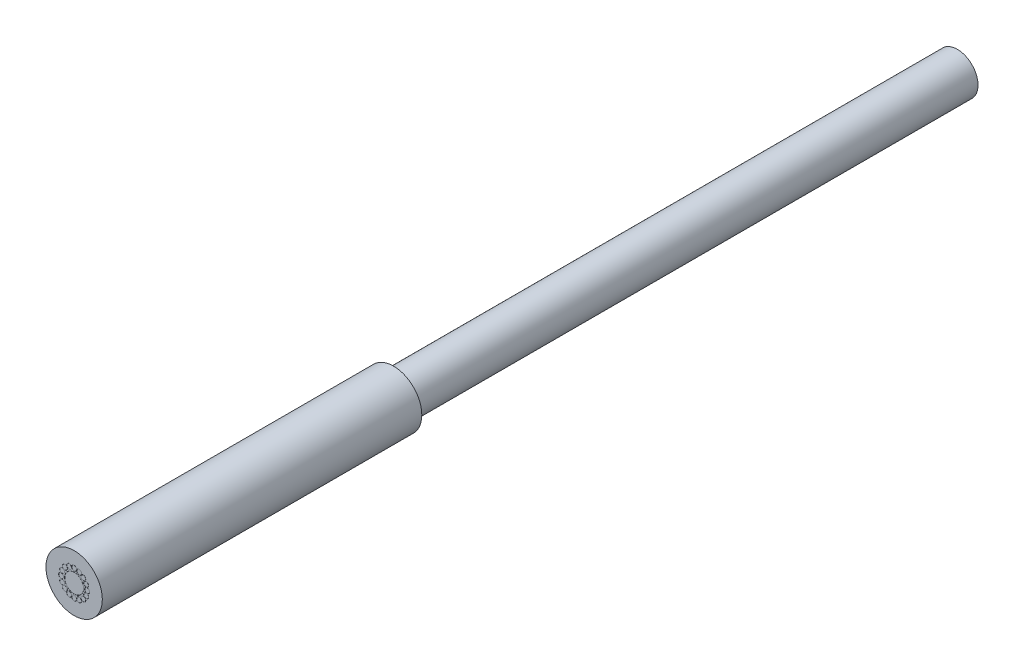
ISO-10303-21;
HEADER;
FILE_DESCRIPTION(('STEP AP214'),'2;1');
FILE_NAME('part.step','',(''),(''),'','','');
FILE_SCHEMA(('AUTOMOTIVE_DESIGN { 1 0 10303 214 1 1 1 1 }'));
ENDSEC;
DATA;
#1=APPLICATION_CONTEXT('core data for automotive mechanical design processes');
#2=APPLICATION_PROTOCOL_DEFINITION('international standard','automotive_design',2000,#1);
#3=PRODUCT_CONTEXT('',#1,'mechanical');
#4=PRODUCT('Part','Part','',(#3));
#5=PRODUCT_RELATED_PRODUCT_CATEGORY('part','',(#4));
#6=PRODUCT_DEFINITION_FORMATION('','',#4);
#7=PRODUCT_DEFINITION_CONTEXT('part definition',#1,'design');
#8=PRODUCT_DEFINITION('design','',#6,#7);
#9=PRODUCT_DEFINITION_SHAPE('','',#8);
#10=(LENGTH_UNIT() NAMED_UNIT(*) SI_UNIT(.MILLI.,.METRE.));
#11=(NAMED_UNIT(*) PLANE_ANGLE_UNIT() SI_UNIT($,.RADIAN.));
#12=(NAMED_UNIT(*) SI_UNIT($,.STERADIAN.) SOLID_ANGLE_UNIT());
#13=UNCERTAINTY_MEASURE_WITH_UNIT(LENGTH_MEASURE(1.E-05),#10,'distance_accuracy_value','');
#14=(GEOMETRIC_REPRESENTATION_CONTEXT(3) GLOBAL_UNCERTAINTY_ASSIGNED_CONTEXT((#13)) GLOBAL_UNIT_ASSIGNED_CONTEXT((#10,
#11,#12)) REPRESENTATION_CONTEXT('',''));
#15=CARTESIAN_POINT('',(0.,0.,0.));
#16=DIRECTION('',(0.,0.,1.));
#17=DIRECTION('',(1.,0.,0.));
#18=AXIS2_PLACEMENT_3D('',#15,#16,#17);
#19=CARTESIAN_POINT('',(0.,0.,-17.));
#20=DIRECTION('',(0.,0.,1.));
#21=DIRECTION('',(1.,0.,0.));
#22=AXIS2_PLACEMENT_3D('',#19,#20,#21);
#23=CYLINDRICAL_SURFACE('',#22,1.5);
#24=CARTESIAN_POINT('',(0.,0.,-17.));
#25=DIRECTION('',(0.,0.,1.));
#26=DIRECTION('',(1.,0.,0.));
#27=AXIS2_PLACEMENT_3D('',#24,#25,#26);
#28=CIRCLE('',#27,1.5);
#29=CARTESIAN_POINT('',(1.5,0.,-17.));
#30=VERTEX_POINT('',#29);
#31=EDGE_CURVE('E40',#30,#30,#28,.T.);
#32=ORIENTED_EDGE('',*,*,#31,.T.);
#33=EDGE_LOOP('',(#32));
#34=FACE_BOUND('',#33,.T.);
#35=CARTESIAN_POINT('',(0.,0.,0.));
#36=DIRECTION('',(0.,0.,1.));
#37=DIRECTION('',(1.,0.,0.));
#38=AXIS2_PLACEMENT_3D('',#35,#36,#37);
#39=CIRCLE('',#38,1.5);
#40=CARTESIAN_POINT('',(1.5,0.,0.));
#41=VERTEX_POINT('',#40);
#42=EDGE_CURVE('E36',#41,#41,#39,.T.);
#43=ORIENTED_EDGE('',*,*,#42,.F.);
#44=EDGE_LOOP('',(#43));
#45=FACE_BOUND('',#44,.T.);
#46=ADVANCED_FACE('F33',(#34,#45),#23,.T.);
#47=CARTESIAN_POINT('',(0.,0.,-17.));
#48=DIRECTION('',(0.,0.,1.));
#49=DIRECTION('',(1.,0.,0.));
#50=AXIS2_PLACEMENT_3D('',#47,#48,#49);
#51=PLANE('',#50);
#52=CARTESIAN_POINT('',(0.,0.,-17.));
#53=DIRECTION('',(0.,0.,-1.));
#54=DIRECTION('',(-1.,0.,0.));
#55=AXIS2_PLACEMENT_3D('',#52,#53,#54);
#56=CIRCLE('',#55,1.1);
#57=CARTESIAN_POINT('',(-1.1,0.,-17.));
#58=VERTEX_POINT('',#57);
#59=EDGE_CURVE('E10',#58,#58,#56,.T.);
#60=ORIENTED_EDGE('',*,*,#59,.F.);
#61=EDGE_LOOP('',(#60));
#62=FACE_BOUND('',#61,.T.);
#63=ORIENTED_EDGE('',*,*,#31,.F.);
#64=EDGE_LOOP('',(#63));
#65=FACE_BOUND('',#64,.T.);
#66=ADVANCED_FACE('F274',(#62,#65),#51,.F.);
#67=CARTESIAN_POINT('',(0.,0.,0.));
#68=DIRECTION('',(0.,0.,1.));
#69=DIRECTION('',(1.,0.,0.));
#70=AXIS2_PLACEMENT_3D('',#67,#68,#69);
#71=PLANE('',#70);
#72=CARTESIAN_POINT('',(0.489308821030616,0.489308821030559,0.));
#73=DIRECTION('',(0.,0.,1.));
#74=DIRECTION('',(1.,0.,0.));
#75=AXIS2_PLACEMENT_3D('',#72,#73,#74);
#76=CIRCLE('',#75,0.13);
#77=CARTESIAN_POINT('',(0.619308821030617,0.489308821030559,0.));
#78=VERTEX_POINT('',#77);
#79=EDGE_CURVE('E136',#78,#78,#76,.T.);
#80=ORIENTED_EDGE('',*,*,#79,.F.);
#81=EDGE_LOOP('',(#80));
#82=FACE_BOUND('',#81,.T.);
#83=CARTESIAN_POINT('',(0.639312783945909,0.264812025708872,0.));
#84=DIRECTION('',(0.,0.,1.));
#85=DIRECTION('',(1.,0.,0.));
#86=AXIS2_PLACEMENT_3D('',#83,#84,#85);
#87=CIRCLE('',#86,0.13);
#88=CARTESIAN_POINT('',(0.769312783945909,0.264812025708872,0.));
#89=VERTEX_POINT('',#88);
#90=EDGE_CURVE('E148',#89,#89,#87,.T.);
#91=ORIENTED_EDGE('',*,*,#90,.F.);
#92=EDGE_LOOP('',(#91));
#93=FACE_BOUND('',#92,.T.);
#94=CARTESIAN_POINT('',(0.26481202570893,0.639312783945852,0.));
#95=DIRECTION('',(0.,0.,1.));
#96=DIRECTION('',(1.,0.,0.));
#97=AXIS2_PLACEMENT_3D('',#94,#95,#96);
#98=CIRCLE('',#97,0.13);
#99=CARTESIAN_POINT('',(0.39481202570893,0.639312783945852,0.));
#100=VERTEX_POINT('',#99);
#101=EDGE_CURVE('E112',#100,#100,#98,.T.);
#102=ORIENTED_EDGE('',*,*,#101,.F.);
#103=EDGE_LOOP('',(#102));
#104=FACE_BOUND('',#103,.T.);
#105=CARTESIAN_POINT('',(0.,0.691987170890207,0.));
#106=DIRECTION('',(0.,0.,1.));
#107=DIRECTION('',(1.,0.,0.));
#108=AXIS2_PLACEMENT_3D('',#105,#106,#107);
#109=CIRCLE('',#108,0.13);
#110=CARTESIAN_POINT('',(0.130000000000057,0.691987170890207,0.));
#111=VERTEX_POINT('',#110);
#112=EDGE_CURVE('E126',#111,#111,#109,.T.);
#113=ORIENTED_EDGE('',*,*,#112,.F.);
#114=EDGE_LOOP('',(#113));
#115=FACE_BOUND('',#114,.T.);
#116=CARTESIAN_POINT('',(0.489308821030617,-0.489308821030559,0.));
#117=DIRECTION('',(0.,0.,1.));
#118=DIRECTION('',(1.,0.,0.));
#119=AXIS2_PLACEMENT_3D('',#116,#117,#118);
#120=CIRCLE('',#119,0.13);
#121=CARTESIAN_POINT('',(0.619308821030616,-0.489308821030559,0.));
#122=VERTEX_POINT('',#121);
#123=EDGE_CURVE('E88',#122,#122,#120,.T.);
#124=ORIENTED_EDGE('',*,*,#123,.F.);
#125=EDGE_LOOP('',(#124));
#126=FACE_BOUND('',#125,.T.);
#127=CARTESIAN_POINT('',(0.264812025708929,-0.639312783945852,0.));
#128=DIRECTION('',(0.,0.,1.));
#129=DIRECTION('',(1.,0.,0.));
#130=AXIS2_PLACEMENT_3D('',#127,#128,#129);
#131=CIRCLE('',#130,0.13);
#132=CARTESIAN_POINT('',(0.39481202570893,-0.639312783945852,0.));
#133=VERTEX_POINT('',#132);
#134=EDGE_CURVE('E100',#133,#133,#131,.T.);
#135=ORIENTED_EDGE('',*,*,#134,.F.);
#136=EDGE_LOOP('',(#135));
#137=FACE_BOUND('',#136,.T.);
#138=CARTESIAN_POINT('',(0.639312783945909,-0.264812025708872,0.));
#139=DIRECTION('',(0.,0.,1.));
#140=DIRECTION('',(1.,0.,0.));
#141=AXIS2_PLACEMENT_3D('',#138,#139,#140);
#142=CIRCLE('',#141,0.13);
#143=CARTESIAN_POINT('',(0.769312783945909,-0.264812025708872,0.));
#144=VERTEX_POINT('',#143);
#145=EDGE_CURVE('E62',#144,#144,#142,.T.);
#146=ORIENTED_EDGE('',*,*,#145,.F.);
#147=EDGE_LOOP('',(#146));
#148=FACE_BOUND('',#147,.T.);
#149=CARTESIAN_POINT('',(0.691987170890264,0.,0.));
#150=DIRECTION('',(0.,0.,1.));
#151=DIRECTION('',(1.,0.,0.));
#152=AXIS2_PLACEMENT_3D('',#149,#150,#151);
#153=CIRCLE('',#152,0.13);
#154=CARTESIAN_POINT('',(0.821987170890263,0.,0.));
#155=VERTEX_POINT('',#154);
#156=EDGE_CURVE('E76',#155,#155,#153,.T.);
#157=ORIENTED_EDGE('',*,*,#156,.F.);
#158=EDGE_LOOP('',(#157));
#159=FACE_BOUND('',#158,.T.);
#160=CARTESIAN_POINT('',(-0.489308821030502,-0.489308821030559,0.));
#161=DIRECTION('',(0.,0.,1.));
#162=DIRECTION('',(1.,0.,0.));
#163=AXIS2_PLACEMENT_3D('',#160,#161,#162);
#164=CIRCLE('',#163,0.13);
#165=CARTESIAN_POINT('',(-0.359308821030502,-0.489308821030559,0.));
#166=VERTEX_POINT('',#165);
#167=EDGE_CURVE('E231',#166,#166,#164,.T.);
#168=ORIENTED_EDGE('',*,*,#167,.F.);
#169=EDGE_LOOP('',(#168));
#170=FACE_BOUND('',#169,.T.);
#171=CARTESIAN_POINT('',(-0.639312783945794,-0.264812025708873,0.));
#172=DIRECTION('',(0.,0.,1.));
#173=DIRECTION('',(1.,0.,0.));
#174=AXIS2_PLACEMENT_3D('',#171,#172,#173);
#175=CIRCLE('',#174,0.13);
#176=CARTESIAN_POINT('',(-0.509312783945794,-0.264812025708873,0.));
#177=VERTEX_POINT('',#176);
#178=EDGE_CURVE('E243',#177,#177,#175,.T.);
#179=ORIENTED_EDGE('',*,*,#178,.F.);
#180=EDGE_LOOP('',(#179));
#181=FACE_BOUND('',#180,.T.);
#182=CARTESIAN_POINT('',(-0.264812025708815,-0.639312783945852,0.));
#183=DIRECTION('',(0.,0.,1.));
#184=DIRECTION('',(1.,0.,0.));
#185=AXIS2_PLACEMENT_3D('',#182,#183,#184);
#186=CIRCLE('',#185,0.13);
#187=CARTESIAN_POINT('',(-0.134812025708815,-0.639312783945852,0.));
#188=VERTEX_POINT('',#187);
#189=EDGE_CURVE('E207',#188,#188,#186,.T.);
#190=ORIENTED_EDGE('',*,*,#189,.F.);
#191=EDGE_LOOP('',(#190));
#192=FACE_BOUND('',#191,.T.);
#193=CARTESIAN_POINT('',(0.,-0.691987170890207,0.));
#194=DIRECTION('',(0.,0.,1.));
#195=DIRECTION('',(1.,0.,0.));
#196=AXIS2_PLACEMENT_3D('',#193,#194,#195);
#197=CIRCLE('',#196,0.13);
#198=CARTESIAN_POINT('',(0.130000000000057,-0.691987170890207,0.));
#199=VERTEX_POINT('',#198);
#200=EDGE_CURVE('E221',#199,#199,#197,.T.);
#201=ORIENTED_EDGE('',*,*,#200,.F.);
#202=EDGE_LOOP('',(#201));
#203=FACE_BOUND('',#202,.T.);
#204=CARTESIAN_POINT('',(-0.489308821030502,0.489308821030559,0.));
#205=DIRECTION('',(0.,0.,1.));
#206=DIRECTION('',(1.,0.,0.));
#207=AXIS2_PLACEMENT_3D('',#204,#205,#206);
#208=CIRCLE('',#207,0.13);
#209=CARTESIAN_POINT('',(-0.359308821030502,0.489308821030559,0.));
#210=VERTEX_POINT('',#209);
#211=EDGE_CURVE('E184',#210,#210,#208,.T.);
#212=ORIENTED_EDGE('',*,*,#211,.F.);
#213=EDGE_LOOP('',(#212));
#214=FACE_BOUND('',#213,.T.);
#215=CARTESIAN_POINT('',(-0.264812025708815,0.639312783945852,0.));
#216=DIRECTION('',(0.,0.,1.));
#217=DIRECTION('',(1.,0.,0.));
#218=AXIS2_PLACEMENT_3D('',#215,#216,#217);
#219=CIRCLE('',#218,0.13);
#220=CARTESIAN_POINT('',(-0.134812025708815,0.639312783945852,0.));
#221=VERTEX_POINT('',#220);
#222=EDGE_CURVE('E196',#221,#221,#219,.T.);
#223=ORIENTED_EDGE('',*,*,#222,.F.);
#224=EDGE_LOOP('',(#223));
#225=FACE_BOUND('',#224,.T.);
#226=CARTESIAN_POINT('',(-0.639312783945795,0.264812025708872,0.));
#227=DIRECTION('',(0.,0.,1.));
#228=DIRECTION('',(1.,0.,0.));
#229=AXIS2_PLACEMENT_3D('',#226,#227,#228);
#230=CIRCLE('',#229,0.13);
#231=CARTESIAN_POINT('',(-0.509312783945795,0.264812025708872,0.));
#232=VERTEX_POINT('',#231);
#233=EDGE_CURVE('E158',#232,#232,#230,.T.);
#234=ORIENTED_EDGE('',*,*,#233,.F.);
#235=EDGE_LOOP('',(#234));
#236=FACE_BOUND('',#235,.T.);
#237=CARTESIAN_POINT('',(-0.691987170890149,0.,0.));
#238=DIRECTION('',(0.,0.,1.));
#239=DIRECTION('',(1.,0.,0.));
#240=AXIS2_PLACEMENT_3D('',#237,#238,#239);
#241=CIRCLE('',#240,0.13);
#242=CARTESIAN_POINT('',(-0.561987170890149,0.,0.));
#243=VERTEX_POINT('',#242);
#244=EDGE_CURVE('E172',#243,#243,#241,.T.);
#245=ORIENTED_EDGE('',*,*,#244,.F.);
#246=EDGE_LOOP('',(#245));
#247=FACE_BOUND('',#246,.T.);
#248=CARTESIAN_POINT('',(0.,0.,0.));
#249=DIRECTION('',(0.,0.,1.));
#250=DIRECTION('',(1.,0.,0.));
#251=AXIS2_PLACEMENT_3D('',#248,#249,#250);
#252=CIRCLE('',#251,0.505);
#253=CARTESIAN_POINT('',(0.505,0.,0.));
#254=VERTEX_POINT('',#253);
#255=EDGE_CURVE('E50',#254,#254,#252,.T.);
#256=ORIENTED_EDGE('',*,*,#255,.F.);
#257=EDGE_LOOP('',(#256));
#258=FACE_BOUND('',#257,.T.);
#259=ORIENTED_EDGE('',*,*,#42,.T.);
#260=EDGE_LOOP('',(#259));
#261=FACE_BOUND('',#260,.T.);
#262=ADVANCED_FACE('F270',(#82,#93,#104,#115,#126,#137,#148,#159,#170,#181,#192,#203,#214,#225,
#236,#247,#258,#261),#71,.T.);
#263=CARTESIAN_POINT('',(0.,0.,-47.));
#264=DIRECTION('',(0.,0.,1.));
#265=DIRECTION('',(1.,0.,0.));
#266=AXIS2_PLACEMENT_3D('',#263,#264,#265);
#267=CYLINDRICAL_SURFACE('',#266,1.1);
#268=CARTESIAN_POINT('',(0.,0.,-47.));
#269=DIRECTION('',(0.,0.,-1.));
#270=DIRECTION('',(-1.,0.,0.));
#271=AXIS2_PLACEMENT_3D('',#268,#269,#270);
#272=CIRCLE('',#271,1.1);
#273=CARTESIAN_POINT('',(-1.1,0.,-47.));
#274=VERTEX_POINT('',#273);
#275=EDGE_CURVE('E46',#274,#274,#272,.T.);
#276=ORIENTED_EDGE('',*,*,#275,.F.);
#277=EDGE_LOOP('',(#276));
#278=FACE_BOUND('',#277,.T.);
#279=ORIENTED_EDGE('',*,*,#59,.T.);
#280=EDGE_LOOP('',(#279));
#281=FACE_BOUND('',#280,.T.);
#282=ADVANCED_FACE('F273',(#278,#281),#267,.T.);
#283=CARTESIAN_POINT('',(0.,0.,-47.));
#284=DIRECTION('',(0.,0.,-1.));
#285=DIRECTION('',(-1.,0.,0.));
#286=AXIS2_PLACEMENT_3D('',#283,#284,#285);
#287=PLANE('',#286);
#288=ORIENTED_EDGE('',*,*,#275,.T.);
#289=EDGE_LOOP('',(#288));
#290=FACE_BOUND('',#289,.T.);
#291=ADVANCED_FACE('F309',(#290),#287,.T.);
#292=CARTESIAN_POINT('',(0.,0.,-0.1));
#293=DIRECTION('',(0.,0.,1.));
#294=DIRECTION('',(1.,0.,0.));
#295=AXIS2_PLACEMENT_3D('',#292,#293,#294);
#296=CYLINDRICAL_SURFACE('',#295,0.505);
#297=CARTESIAN_POINT('',(0.,0.,-0.1));
#298=DIRECTION('',(0.,0.,1.));
#299=DIRECTION('',(1.,0.,0.));
#300=AXIS2_PLACEMENT_3D('',#297,#298,#299);
#301=CIRCLE('',#300,0.505);
#302=CARTESIAN_POINT('',(0.505,0.,-0.1));
#303=VERTEX_POINT('',#302);
#304=EDGE_CURVE('E49',#303,#303,#301,.T.);
#305=ORIENTED_EDGE('',*,*,#304,.F.);
#306=EDGE_LOOP('',(#305));
#307=FACE_BOUND('',#306,.T.);
#308=ORIENTED_EDGE('',*,*,#255,.T.);
#309=EDGE_LOOP('',(#308));
#310=FACE_BOUND('',#309,.T.);
#311=ADVANCED_FACE('F313',(#307,#310),#296,.F.);
#312=CARTESIAN_POINT('',(0.,0.,-0.1));
#313=DIRECTION('',(0.,0.,1.));
#314=DIRECTION('',(1.,0.,0.));
#315=AXIS2_PLACEMENT_3D('',#312,#313,#314);
#316=PLANE('',#315);
#317=CARTESIAN_POINT('',(0.,0.,-0.1));
#318=DIRECTION('',(0.,0.,1.));
#319=DIRECTION('',(1.,0.,0.));
#320=AXIS2_PLACEMENT_3D('',#317,#318,#319);
#321=CIRCLE('',#320,0.5);
#322=CARTESIAN_POINT('',(0.5,0.,-0.1));
#323=VERTEX_POINT('',#322);
#324=EDGE_CURVE('E53',#323,#323,#321,.T.);
#325=ORIENTED_EDGE('',*,*,#324,.F.);
#326=EDGE_LOOP('',(#325));
#327=FACE_BOUND('',#326,.T.);
#328=ORIENTED_EDGE('',*,*,#304,.T.);
#329=EDGE_LOOP('',(#328));
#330=FACE_BOUND('',#329,.T.);
#331=ADVANCED_FACE('F317',(#327,#330),#316,.T.);
#332=CARTESIAN_POINT('',(0.,0.,-0.1));
#333=DIRECTION('',(0.,0.,1.));
#334=DIRECTION('',(1.,0.,0.));
#335=AXIS2_PLACEMENT_3D('',#332,#333,#334);
#336=CYLINDRICAL_SURFACE('',#335,0.5);
#337=ORIENTED_EDGE('',*,*,#324,.T.);
#338=EDGE_LOOP('',(#337));
#339=FACE_BOUND('',#338,.T.);
#340=CARTESIAN_POINT('',(0.,0.,0.));
#341=DIRECTION('',(0.,0.,1.));
#342=DIRECTION('',(1.,0.,0.));
#343=AXIS2_PLACEMENT_3D('',#340,#341,#342);
#344=CIRCLE('',#343,0.5);
#345=CARTESIAN_POINT('',(0.5,0.,0.));
#346=VERTEX_POINT('',#345);
#347=EDGE_CURVE('E56',#346,#346,#344,.T.);
#348=ORIENTED_EDGE('',*,*,#347,.F.);
#349=EDGE_LOOP('',(#348));
#350=FACE_BOUND('',#349,.T.);
#351=ADVANCED_FACE('F321',(#339,#350),#336,.T.);
#352=CARTESIAN_POINT('',(-0.691987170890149,0.,-0.1));
#353=DIRECTION('',(0.,0.,1.));
#354=DIRECTION('',(1.,0.,0.));
#355=AXIS2_PLACEMENT_3D('',#352,#353,#354);
#356=CYLINDRICAL_SURFACE('',#355,0.13);
#357=CARTESIAN_POINT('',(-0.691987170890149,0.,-0.1));
#358=DIRECTION('',(0.,0.,1.));
#359=DIRECTION('',(1.,0.,0.));
#360=AXIS2_PLACEMENT_3D('',#357,#358,#359);
#361=CIRCLE('',#360,0.13);
#362=CARTESIAN_POINT('',(-0.561987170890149,0.,-0.1));
#363=VERTEX_POINT('',#362);
#364=EDGE_CURVE('E175',#363,#363,#361,.T.);
#365=ORIENTED_EDGE('',*,*,#364,.F.);
#366=EDGE_LOOP('',(#365));
#367=FACE_BOUND('',#366,.T.);
#368=ORIENTED_EDGE('',*,*,#244,.T.);
#369=EDGE_LOOP('',(#368));
#370=FACE_BOUND('',#369,.T.);
#371=ADVANCED_FACE('F325',(#367,#370),#356,.F.);
#372=CARTESIAN_POINT('',(-0.691987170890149,0.,-0.1));
#373=DIRECTION('',(0.,0.,1.));
#374=DIRECTION('',(1.,0.,0.));
#375=AXIS2_PLACEMENT_3D('',#372,#373,#374);
#376=PLANE('',#375);
#377=CARTESIAN_POINT('',(-0.691987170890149,0.,-0.1));
#378=DIRECTION('',(0.,0.,1.));
#379=DIRECTION('',(1.,0.,0.));
#380=AXIS2_PLACEMENT_3D('',#377,#378,#379);
#381=CIRCLE('',#380,0.125);
#382=CARTESIAN_POINT('',(-0.566987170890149,0.,-0.1));
#383=VERTEX_POINT('',#382);
#384=EDGE_CURVE('E176',#383,#383,#381,.T.);
#385=ORIENTED_EDGE('',*,*,#384,.F.);
#386=EDGE_LOOP('',(#385));
#387=FACE_BOUND('',#386,.T.);
#388=ORIENTED_EDGE('',*,*,#364,.T.);
#389=EDGE_LOOP('',(#388));
#390=FACE_BOUND('',#389,.T.);
#391=ADVANCED_FACE('F440',(#387,#390),#376,.T.);
#392=CARTESIAN_POINT('',(-0.691987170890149,0.,-0.1));
#393=DIRECTION('',(0.,0.,1.));
#394=DIRECTION('',(1.,0.,0.));
#395=AXIS2_PLACEMENT_3D('',#392,#393,#394);
#396=CYLINDRICAL_SURFACE('',#395,0.125);
#397=ORIENTED_EDGE('',*,*,#384,.T.);
#398=EDGE_LOOP('',(#397));
#399=FACE_BOUND('',#398,.T.);
#400=CARTESIAN_POINT('',(-0.691987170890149,0.,0.));
#401=DIRECTION('',(0.,0.,1.));
#402=DIRECTION('',(1.,0.,0.));
#403=AXIS2_PLACEMENT_3D('',#400,#401,#402);
#404=CIRCLE('',#403,0.125);
#405=CARTESIAN_POINT('',(-0.566987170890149,0.,0.));
#406=VERTEX_POINT('',#405);
#407=EDGE_CURVE('E165',#406,#406,#404,.T.);
#408=ORIENTED_EDGE('',*,*,#407,.F.);
#409=EDGE_LOOP('',(#408));
#410=FACE_BOUND('',#409,.T.);
#411=ADVANCED_FACE('F428',(#399,#410),#396,.T.);
#412=CARTESIAN_POINT('',(-0.639312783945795,0.264812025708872,-0.1));
#413=DIRECTION('',(0.,0.,1.));
#414=DIRECTION('',(1.,0.,0.));
#415=AXIS2_PLACEMENT_3D('',#412,#413,#414);
#416=CYLINDRICAL_SURFACE('',#415,0.13);
#417=CARTESIAN_POINT('',(-0.639312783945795,0.264812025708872,-0.1));
#418=DIRECTION('',(0.,0.,1.));
#419=DIRECTION('',(1.,0.,0.));
#420=AXIS2_PLACEMENT_3D('',#417,#418,#419);
#421=CIRCLE('',#420,0.13);
#422=CARTESIAN_POINT('',(-0.509312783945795,0.264812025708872,-0.1));
#423=VERTEX_POINT('',#422);
#424=EDGE_CURVE('E161',#423,#423,#421,.T.);
#425=ORIENTED_EDGE('',*,*,#424,.F.);
#426=EDGE_LOOP('',(#425));
#427=FACE_BOUND('',#426,.T.);
#428=ORIENTED_EDGE('',*,*,#233,.T.);
#429=EDGE_LOOP('',(#428));
#430=FACE_BOUND('',#429,.T.);
#431=ADVANCED_FACE('F424',(#427,#430),#416,.F.);
#432=CARTESIAN_POINT('',(-0.639312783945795,0.264812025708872,-0.1));
#433=DIRECTION('',(0.,0.,1.));
#434=DIRECTION('',(1.,0.,0.));
#435=AXIS2_PLACEMENT_3D('',#432,#433,#434);
#436=PLANE('',#435);
#437=CARTESIAN_POINT('',(-0.639312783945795,0.264812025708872,-0.1));
#438=DIRECTION('',(0.,0.,1.));
#439=DIRECTION('',(1.,0.,0.));
#440=AXIS2_PLACEMENT_3D('',#437,#438,#439);
#441=CIRCLE('',#440,0.125);
#442=CARTESIAN_POINT('',(-0.514312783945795,0.264812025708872,-0.1));
#443=VERTEX_POINT('',#442);
#444=EDGE_CURVE('E162',#443,#443,#441,.T.);
#445=ORIENTED_EDGE('',*,*,#444,.F.);
#446=EDGE_LOOP('',(#445));
#447=FACE_BOUND('',#446,.T.);
#448=ORIENTED_EDGE('',*,*,#424,.T.);
#449=EDGE_LOOP('',(#448));
#450=FACE_BOUND('',#449,.T.);
#451=ADVANCED_FACE('F427',(#447,#450),#436,.T.);
#452=CARTESIAN_POINT('',(-0.639312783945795,0.264812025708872,-0.1));
#453=DIRECTION('',(0.,0.,1.));
#454=DIRECTION('',(1.,0.,0.));
#455=AXIS2_PLACEMENT_3D('',#452,#453,#454);
#456=CYLINDRICAL_SURFACE('',#455,0.125);
#457=ORIENTED_EDGE('',*,*,#444,.T.);
#458=EDGE_LOOP('',(#457));
#459=FACE_BOUND('',#458,.T.);
#460=CARTESIAN_POINT('',(-0.639312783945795,0.264812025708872,0.));
#461=DIRECTION('',(0.,0.,1.));
#462=DIRECTION('',(1.,0.,0.));
#463=AXIS2_PLACEMENT_3D('',#460,#461,#462);
#464=CIRCLE('',#463,0.125);
#465=CARTESIAN_POINT('',(-0.514312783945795,0.264812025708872,0.));
#466=VERTEX_POINT('',#465);
#467=EDGE_CURVE('E166',#466,#466,#464,.T.);
#468=ORIENTED_EDGE('',*,*,#467,.F.);
#469=EDGE_LOOP('',(#468));
#470=FACE_BOUND('',#469,.T.);
#471=ADVANCED_FACE('F432',(#459,#470),#456,.T.);
#472=CARTESIAN_POINT('',(-0.264812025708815,0.639312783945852,-0.1));
#473=DIRECTION('',(0.,0.,1.));
#474=DIRECTION('',(1.,0.,0.));
#475=AXIS2_PLACEMENT_3D('',#472,#473,#474);
#476=CYLINDRICAL_SURFACE('',#475,0.13);
#477=CARTESIAN_POINT('',(-0.264812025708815,0.639312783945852,-0.1));
#478=DIRECTION('',(0.,0.,1.));
#479=DIRECTION('',(1.,0.,0.));
#480=AXIS2_PLACEMENT_3D('',#477,#478,#479);
#481=CIRCLE('',#480,0.13);
#482=CARTESIAN_POINT('',(-0.134812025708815,0.639312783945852,-0.1));
#483=VERTEX_POINT('',#482);
#484=EDGE_CURVE('E193',#483,#483,#481,.T.);
#485=ORIENTED_EDGE('',*,*,#484,.F.);
#486=EDGE_LOOP('',(#485));
#487=FACE_BOUND('',#486,.T.);
#488=ORIENTED_EDGE('',*,*,#222,.T.);
#489=EDGE_LOOP('',(#488));
#490=FACE_BOUND('',#489,.T.);
#491=ADVANCED_FACE('F436',(#487,#490),#476,.F.);
#492=CARTESIAN_POINT('',(-0.264812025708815,0.639312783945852,-0.1));
#493=DIRECTION('',(0.,0.,1.));
#494=DIRECTION('',(1.,0.,0.));
#495=AXIS2_PLACEMENT_3D('',#492,#493,#494);
#496=PLANE('',#495);
#497=CARTESIAN_POINT('',(-0.264812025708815,0.639312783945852,-0.1));
#498=DIRECTION('',(0.,0.,1.));
#499=DIRECTION('',(1.,0.,0.));
#500=AXIS2_PLACEMENT_3D('',#497,#498,#499);
#501=CIRCLE('',#500,0.125);
#502=CARTESIAN_POINT('',(-0.139812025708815,0.639312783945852,-0.1));
#503=VERTEX_POINT('',#502);
#504=EDGE_CURVE('E199',#503,#503,#501,.T.);
#505=ORIENTED_EDGE('',*,*,#504,.F.);
#506=EDGE_LOOP('',(#505));
#507=FACE_BOUND('',#506,.T.);
#508=ORIENTED_EDGE('',*,*,#484,.T.);
#509=EDGE_LOOP('',(#508));
#510=FACE_BOUND('',#509,.T.);
#511=ADVANCED_FACE('F464',(#507,#510),#496,.T.);
#512=CARTESIAN_POINT('',(-0.264812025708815,0.639312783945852,-0.1));
#513=DIRECTION('',(0.,0.,1.));
#514=DIRECTION('',(1.,0.,0.));
#515=AXIS2_PLACEMENT_3D('',#512,#513,#514);
#516=CYLINDRICAL_SURFACE('',#515,0.125);
#517=ORIENTED_EDGE('',*,*,#504,.T.);
#518=EDGE_LOOP('',(#517));
#519=FACE_BOUND('',#518,.T.);
#520=CARTESIAN_POINT('',(-0.264812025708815,0.639312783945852,0.));
#521=DIRECTION('',(0.,0.,1.));
#522=DIRECTION('',(1.,0.,0.));
#523=AXIS2_PLACEMENT_3D('',#520,#521,#522);
#524=CIRCLE('',#523,0.125);
#525=CARTESIAN_POINT('',(-0.139812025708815,0.639312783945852,0.));
#526=VERTEX_POINT('',#525);
#527=EDGE_CURVE('E202',#526,#526,#524,.T.);
#528=ORIENTED_EDGE('',*,*,#527,.F.);
#529=EDGE_LOOP('',(#528));
#530=FACE_BOUND('',#529,.T.);
#531=ADVANCED_FACE('F452',(#519,#530),#516,.T.);
#532=CARTESIAN_POINT('',(-0.489308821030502,0.489308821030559,-0.1));
#533=DIRECTION('',(0.,0.,1.));
#534=DIRECTION('',(1.,0.,0.));
#535=AXIS2_PLACEMENT_3D('',#532,#533,#534);
#536=CYLINDRICAL_SURFACE('',#535,0.13);
#537=CARTESIAN_POINT('',(-0.489308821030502,0.489308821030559,-0.1));
#538=DIRECTION('',(0.,0.,1.));
#539=DIRECTION('',(1.,0.,0.));
#540=AXIS2_PLACEMENT_3D('',#537,#538,#539);
#541=CIRCLE('',#540,0.13);
#542=CARTESIAN_POINT('',(-0.359308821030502,0.489308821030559,-0.1));
#543=VERTEX_POINT('',#542);
#544=EDGE_CURVE('E169',#543,#543,#541,.T.);
#545=ORIENTED_EDGE('',*,*,#544,.F.);
#546=EDGE_LOOP('',(#545));
#547=FACE_BOUND('',#546,.T.);
#548=ORIENTED_EDGE('',*,*,#211,.T.);
#549=EDGE_LOOP('',(#548));
#550=FACE_BOUND('',#549,.T.);
#551=ADVANCED_FACE('F448',(#547,#550),#536,.F.);
#552=CARTESIAN_POINT('',(-0.489308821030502,0.489308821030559,-0.1));
#553=DIRECTION('',(0.,0.,1.));
#554=DIRECTION('',(1.,0.,0.));
#555=AXIS2_PLACEMENT_3D('',#552,#553,#554);
#556=PLANE('',#555);
#557=CARTESIAN_POINT('',(-0.489308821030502,0.489308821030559,-0.1));
#558=DIRECTION('',(0.,0.,1.));
#559=DIRECTION('',(1.,0.,0.));
#560=AXIS2_PLACEMENT_3D('',#557,#558,#559);
#561=CIRCLE('',#560,0.125);
#562=CARTESIAN_POINT('',(-0.364308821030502,0.489308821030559,-0.1));
#563=VERTEX_POINT('',#562);
#564=EDGE_CURVE('E187',#563,#563,#561,.T.);
#565=ORIENTED_EDGE('',*,*,#564,.F.);
#566=EDGE_LOOP('',(#565));
#567=FACE_BOUND('',#566,.T.);
#568=ORIENTED_EDGE('',*,*,#544,.T.);
#569=EDGE_LOOP('',(#568));
#570=FACE_BOUND('',#569,.T.);
#571=ADVANCED_FACE('F451',(#567,#570),#556,.T.);
#572=CARTESIAN_POINT('',(-0.489308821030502,0.489308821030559,-0.1));
#573=DIRECTION('',(0.,0.,1.));
#574=DIRECTION('',(1.,0.,0.));
#575=AXIS2_PLACEMENT_3D('',#572,#573,#574);
#576=CYLINDRICAL_SURFACE('',#575,0.125);
#577=ORIENTED_EDGE('',*,*,#564,.T.);
#578=EDGE_LOOP('',(#577));
#579=FACE_BOUND('',#578,.T.);
#580=CARTESIAN_POINT('',(-0.489308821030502,0.489308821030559,0.));
#581=DIRECTION('',(0.,0.,1.));
#582=DIRECTION('',(1.,0.,0.));
#583=AXIS2_PLACEMENT_3D('',#580,#581,#582);
#584=CIRCLE('',#583,0.125);
#585=CARTESIAN_POINT('',(-0.364308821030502,0.489308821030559,0.));
#586=VERTEX_POINT('',#585);
#587=EDGE_CURVE('E190',#586,#586,#584,.T.);
#588=ORIENTED_EDGE('',*,*,#587,.F.);
#589=EDGE_LOOP('',(#588));
#590=FACE_BOUND('',#589,.T.);
#591=ADVANCED_FACE('F456',(#579,#590),#576,.T.);
#592=CARTESIAN_POINT('',(0.,-0.691987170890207,-0.1));
#593=DIRECTION('',(0.,0.,1.));
#594=DIRECTION('',(1.,0.,0.));
#595=AXIS2_PLACEMENT_3D('',#592,#593,#594);
#596=CYLINDRICAL_SURFACE('',#595,0.13);
#597=CARTESIAN_POINT('',(0.,-0.691987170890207,-0.1));
#598=DIRECTION('',(0.,0.,1.));
#599=DIRECTION('',(1.,0.,0.));
#600=AXIS2_PLACEMENT_3D('',#597,#598,#599);
#601=CIRCLE('',#600,0.13);
#602=CARTESIAN_POINT('',(0.130000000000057,-0.691987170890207,-0.1));
#603=VERTEX_POINT('',#602);
#604=EDGE_CURVE('E109',#603,#603,#601,.T.);
#605=ORIENTED_EDGE('',*,*,#604,.F.);
#606=EDGE_LOOP('',(#605));
#607=FACE_BOUND('',#606,.T.);
#608=ORIENTED_EDGE('',*,*,#200,.T.);
#609=EDGE_LOOP('',(#608));
#610=FACE_BOUND('',#609,.T.);
#611=ADVANCED_FACE('F460',(#607,#610),#596,.F.);
#612=CARTESIAN_POINT('',(0.,-0.691987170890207,-0.1));
#613=DIRECTION('',(0.,0.,1.));
#614=DIRECTION('',(1.,0.,0.));
#615=AXIS2_PLACEMENT_3D('',#612,#613,#614);
#616=PLANE('',#615);
#617=CARTESIAN_POINT('',(0.,-0.691987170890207,-0.1));
#618=DIRECTION('',(0.,0.,1.));
#619=DIRECTION('',(1.,0.,0.));
#620=AXIS2_PLACEMENT_3D('',#617,#618,#619);
#621=CIRCLE('',#620,0.125);
#622=CARTESIAN_POINT('',(0.125000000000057,-0.691987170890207,-0.1));
#623=VERTEX_POINT('',#622);
#624=EDGE_CURVE('E224',#623,#623,#621,.T.);
#625=ORIENTED_EDGE('',*,*,#624,.F.);
#626=EDGE_LOOP('',(#625));
#627=FACE_BOUND('',#626,.T.);
#628=ORIENTED_EDGE('',*,*,#604,.T.);
#629=EDGE_LOOP('',(#628));
#630=FACE_BOUND('',#629,.T.);
#631=ADVANCED_FACE('F486',(#627,#630),#616,.T.);
#632=CARTESIAN_POINT('',(0.,-0.691987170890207,-0.1));
#633=DIRECTION('',(0.,0.,1.));
#634=DIRECTION('',(1.,0.,0.));
#635=AXIS2_PLACEMENT_3D('',#632,#633,#634);
#636=CYLINDRICAL_SURFACE('',#635,0.125);
#637=ORIENTED_EDGE('',*,*,#624,.T.);
#638=EDGE_LOOP('',(#637));
#639=FACE_BOUND('',#638,.T.);
#640=CARTESIAN_POINT('',(0.,-0.691987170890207,0.));
#641=DIRECTION('',(0.,0.,1.));
#642=DIRECTION('',(1.,0.,0.));
#643=AXIS2_PLACEMENT_3D('',#640,#641,#642);
#644=CIRCLE('',#643,0.125);
#645=CARTESIAN_POINT('',(0.125000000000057,-0.691987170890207,0.));
#646=VERTEX_POINT('',#645);
#647=EDGE_CURVE('E214',#646,#646,#644,.T.);
#648=ORIENTED_EDGE('',*,*,#647,.F.);
#649=EDGE_LOOP('',(#648));
#650=FACE_BOUND('',#649,.T.);
#651=ADVANCED_FACE('F476',(#639,#650),#636,.T.);
#652=CARTESIAN_POINT('',(-0.264812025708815,-0.639312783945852,-0.1));
#653=DIRECTION('',(0.,0.,1.));
#654=DIRECTION('',(1.,0.,0.));
#655=AXIS2_PLACEMENT_3D('',#652,#653,#654);
#656=CYLINDRICAL_SURFACE('',#655,0.13);
#657=CARTESIAN_POINT('',(-0.264812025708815,-0.639312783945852,-0.1));
#658=DIRECTION('',(0.,0.,1.));
#659=DIRECTION('',(1.,0.,0.));
#660=AXIS2_PLACEMENT_3D('',#657,#658,#659);
#661=CIRCLE('',#660,0.13);
#662=CARTESIAN_POINT('',(-0.134812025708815,-0.639312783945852,-0.1));
#663=VERTEX_POINT('',#662);
#664=EDGE_CURVE('E210',#663,#663,#661,.T.);
#665=ORIENTED_EDGE('',*,*,#664,.F.);
#666=EDGE_LOOP('',(#665));
#667=FACE_BOUND('',#666,.T.);
#668=ORIENTED_EDGE('',*,*,#189,.T.);
#669=EDGE_LOOP('',(#668));
#670=FACE_BOUND('',#669,.T.);
#671=ADVANCED_FACE('F472',(#667,#670),#656,.F.);
#672=CARTESIAN_POINT('',(-0.264812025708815,-0.639312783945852,-0.1));
#673=DIRECTION('',(0.,0.,1.));
#674=DIRECTION('',(1.,0.,0.));
#675=AXIS2_PLACEMENT_3D('',#672,#673,#674);
#676=PLANE('',#675);
#677=CARTESIAN_POINT('',(-0.264812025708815,-0.639312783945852,-0.1));
#678=DIRECTION('',(0.,0.,1.));
#679=DIRECTION('',(1.,0.,0.));
#680=AXIS2_PLACEMENT_3D('',#677,#678,#679);
#681=CIRCLE('',#680,0.125);
#682=CARTESIAN_POINT('',(-0.139812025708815,-0.639312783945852,-0.1));
#683=VERTEX_POINT('',#682);
#684=EDGE_CURVE('E211',#683,#683,#681,.T.);
#685=ORIENTED_EDGE('',*,*,#684,.F.);
#686=EDGE_LOOP('',(#685));
#687=FACE_BOUND('',#686,.T.);
#688=ORIENTED_EDGE('',*,*,#664,.T.);
#689=EDGE_LOOP('',(#688));
#690=FACE_BOUND('',#689,.T.);
#691=ADVANCED_FACE('F475',(#687,#690),#676,.T.);
#692=CARTESIAN_POINT('',(-0.264812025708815,-0.639312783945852,-0.1));
#693=DIRECTION('',(0.,0.,1.));
#694=DIRECTION('',(1.,0.,0.));
#695=AXIS2_PLACEMENT_3D('',#692,#693,#694);
#696=CYLINDRICAL_SURFACE('',#695,0.125);
#697=ORIENTED_EDGE('',*,*,#684,.T.);
#698=EDGE_LOOP('',(#697));
#699=FACE_BOUND('',#698,.T.);
#700=CARTESIAN_POINT('',(-0.264812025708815,-0.639312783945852,0.));
#701=DIRECTION('',(0.,0.,1.));
#702=DIRECTION('',(1.,0.,0.));
#703=AXIS2_PLACEMENT_3D('',#700,#701,#702);
#704=CIRCLE('',#703,0.125);
#705=CARTESIAN_POINT('',(-0.139812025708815,-0.639312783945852,0.));
#706=VERTEX_POINT('',#705);
#707=EDGE_CURVE('E215',#706,#706,#704,.T.);
#708=ORIENTED_EDGE('',*,*,#707,.F.);
#709=EDGE_LOOP('',(#708));
#710=FACE_BOUND('',#709,.T.);
#711=ADVANCED_FACE('F266',(#699,#710),#696,.T.);
#712=CARTESIAN_POINT('',(-0.639312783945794,-0.264812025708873,-0.1));
#713=DIRECTION('',(0.,0.,1.));
#714=DIRECTION('',(1.,0.,0.));
#715=AXIS2_PLACEMENT_3D('',#712,#713,#714);
#716=CYLINDRICAL_SURFACE('',#715,0.13);
#717=CARTESIAN_POINT('',(-0.639312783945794,-0.264812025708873,-0.1));
#718=DIRECTION('',(0.,0.,1.));
#719=DIRECTION('',(1.,0.,0.));
#720=AXIS2_PLACEMENT_3D('',#717,#718,#719);
#721=CIRCLE('',#720,0.13);
#722=CARTESIAN_POINT('',(-0.509312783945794,-0.264812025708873,-0.1));
#723=VERTEX_POINT('',#722);
#724=EDGE_CURVE('E240',#723,#723,#721,.T.);
#725=ORIENTED_EDGE('',*,*,#724,.F.);
#726=EDGE_LOOP('',(#725));
#727=FACE_BOUND('',#726,.T.);
#728=ORIENTED_EDGE('',*,*,#178,.T.);
#729=EDGE_LOOP('',(#728));
#730=FACE_BOUND('',#729,.T.);
#731=ADVANCED_FACE('F260',(#727,#730),#716,.F.);
#732=CARTESIAN_POINT('',(-0.639312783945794,-0.264812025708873,-0.1));
#733=DIRECTION('',(0.,0.,1.));
#734=DIRECTION('',(1.,0.,0.));
#735=AXIS2_PLACEMENT_3D('',#732,#733,#734);
#736=PLANE('',#735);
#737=CARTESIAN_POINT('',(-0.639312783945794,-0.264812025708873,-0.1));
#738=DIRECTION('',(0.,0.,1.));
#739=DIRECTION('',(1.,0.,0.));
#740=AXIS2_PLACEMENT_3D('',#737,#738,#739);
#741=CIRCLE('',#740,0.125);
#742=CARTESIAN_POINT('',(-0.514312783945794,-0.264812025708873,-0.1));
#743=VERTEX_POINT('',#742);
#744=EDGE_CURVE('E246',#743,#743,#741,.T.);
#745=ORIENTED_EDGE('',*,*,#744,.F.);
#746=EDGE_LOOP('',(#745));
#747=FACE_BOUND('',#746,.T.);
#748=ORIENTED_EDGE('',*,*,#724,.T.);
#749=EDGE_LOOP('',(#748));
#750=FACE_BOUND('',#749,.T.);
#751=ADVANCED_FACE('F257',(#747,#750),#736,.T.);
#752=CARTESIAN_POINT('',(-0.639312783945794,-0.264812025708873,-0.1));
#753=DIRECTION('',(0.,0.,1.));
#754=DIRECTION('',(1.,0.,0.));
#755=AXIS2_PLACEMENT_3D('',#752,#753,#754);
#756=CYLINDRICAL_SURFACE('',#755,0.125);
#757=ORIENTED_EDGE('',*,*,#744,.T.);
#758=EDGE_LOOP('',(#757));
#759=FACE_BOUND('',#758,.T.);
#760=CARTESIAN_POINT('',(-0.639312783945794,-0.264812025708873,0.));
#761=DIRECTION('',(0.,0.,1.));
#762=DIRECTION('',(1.,0.,0.));
#763=AXIS2_PLACEMENT_3D('',#760,#761,#762);
#764=CIRCLE('',#763,0.125);
#765=CARTESIAN_POINT('',(-0.514312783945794,-0.264812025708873,0.));
#766=VERTEX_POINT('',#765);
#767=EDGE_CURVE('E179',#766,#766,#764,.T.);
#768=ORIENTED_EDGE('',*,*,#767,.F.);
#769=EDGE_LOOP('',(#768));
#770=FACE_BOUND('',#769,.T.);
#771=ADVANCED_FACE('F254',(#759,#770),#756,.T.);
#772=CARTESIAN_POINT('',(-0.489308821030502,-0.489308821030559,-0.1));
#773=DIRECTION('',(0.,0.,1.));
#774=DIRECTION('',(1.,0.,0.));
#775=AXIS2_PLACEMENT_3D('',#772,#773,#774);
#776=CYLINDRICAL_SURFACE('',#775,0.13);
#777=CARTESIAN_POINT('',(-0.489308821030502,-0.489308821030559,-0.1));
#778=DIRECTION('',(0.,0.,1.));
#779=DIRECTION('',(1.,0.,0.));
#780=AXIS2_PLACEMENT_3D('',#777,#778,#779);
#781=CIRCLE('',#780,0.13);
#782=CARTESIAN_POINT('',(-0.359308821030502,-0.489308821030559,-0.1));
#783=VERTEX_POINT('',#782);
#784=EDGE_CURVE('E218',#783,#783,#781,.T.);
#785=ORIENTED_EDGE('',*,*,#784,.F.);
#786=EDGE_LOOP('',(#785));
#787=FACE_BOUND('',#786,.T.);
#788=ORIENTED_EDGE('',*,*,#167,.T.);
#789=EDGE_LOOP('',(#788));
#790=FACE_BOUND('',#789,.T.);
#791=ADVANCED_FACE('F494',(#787,#790),#776,.F.);
#792=CARTESIAN_POINT('',(-0.489308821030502,-0.489308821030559,-0.1));
#793=DIRECTION('',(0.,0.,1.));
#794=DIRECTION('',(1.,0.,0.));
#795=AXIS2_PLACEMENT_3D('',#792,#793,#794);
#796=PLANE('',#795);
#797=CARTESIAN_POINT('',(-0.489308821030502,-0.489308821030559,-0.1));
#798=DIRECTION('',(0.,0.,1.));
#799=DIRECTION('',(1.,0.,0.));
#800=AXIS2_PLACEMENT_3D('',#797,#798,#799);
#801=CIRCLE('',#800,0.125);
#802=CARTESIAN_POINT('',(-0.364308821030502,-0.489308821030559,-0.1));
#803=VERTEX_POINT('',#802);
#804=EDGE_CURVE('E234',#803,#803,#801,.T.);
#805=ORIENTED_EDGE('',*,*,#804,.F.);
#806=EDGE_LOOP('',(#805));
#807=FACE_BOUND('',#806,.T.);
#808=ORIENTED_EDGE('',*,*,#784,.T.);
#809=EDGE_LOOP('',(#808));
#810=FACE_BOUND('',#809,.T.);
#811=ADVANCED_FACE('F497',(#807,#810),#796,.T.);
#812=CARTESIAN_POINT('',(-0.489308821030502,-0.489308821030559,-0.1));
#813=DIRECTION('',(0.,0.,1.));
#814=DIRECTION('',(1.,0.,0.));
#815=AXIS2_PLACEMENT_3D('',#812,#813,#814);
#816=CYLINDRICAL_SURFACE('',#815,0.125);
#817=ORIENTED_EDGE('',*,*,#804,.T.);
#818=EDGE_LOOP('',(#817));
#819=FACE_BOUND('',#818,.T.);
#820=CARTESIAN_POINT('',(-0.489308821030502,-0.489308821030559,0.));
#821=DIRECTION('',(0.,0.,1.));
#822=DIRECTION('',(1.,0.,0.));
#823=AXIS2_PLACEMENT_3D('',#820,#821,#822);
#824=CIRCLE('',#823,0.125);
#825=CARTESIAN_POINT('',(-0.364308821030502,-0.489308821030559,0.));
#826=VERTEX_POINT('',#825);
#827=EDGE_CURVE('E237',#826,#826,#824,.T.);
#828=ORIENTED_EDGE('',*,*,#827,.F.);
#829=EDGE_LOOP('',(#828));
#830=FACE_BOUND('',#829,.T.);
#831=ADVANCED_FACE('F345',(#819,#830),#816,.T.);
#832=CARTESIAN_POINT('',(0.691987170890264,0.,-0.1));
#833=DIRECTION('',(0.,0.,1.));
#834=DIRECTION('',(1.,0.,0.));
#835=AXIS2_PLACEMENT_3D('',#832,#833,#834);
#836=CYLINDRICAL_SURFACE('',#835,0.13);
#837=CARTESIAN_POINT('',(0.691987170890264,0.,-0.1));
#838=DIRECTION('',(0.,0.,1.));
#839=DIRECTION('',(1.,0.,0.));
#840=AXIS2_PLACEMENT_3D('',#837,#838,#839);
#841=CIRCLE('',#840,0.13);
#842=CARTESIAN_POINT('',(0.821987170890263,0.,-0.1));
#843=VERTEX_POINT('',#842);
#844=EDGE_CURVE('E79',#843,#843,#841,.T.);
#845=ORIENTED_EDGE('',*,*,#844,.F.);
#846=EDGE_LOOP('',(#845));
#847=FACE_BOUND('',#846,.T.);
#848=ORIENTED_EDGE('',*,*,#156,.T.);
#849=EDGE_LOOP('',(#848));
#850=FACE_BOUND('',#849,.T.);
#851=ADVANCED_FACE('F341',(#847,#850),#836,.F.);
#852=CARTESIAN_POINT('',(0.691987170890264,0.,-0.1));
#853=DIRECTION('',(0.,0.,1.));
#854=DIRECTION('',(1.,0.,0.));
#855=AXIS2_PLACEMENT_3D('',#852,#853,#854);
#856=PLANE('',#855);
#857=CARTESIAN_POINT('',(0.691987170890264,0.,-0.1));
#858=DIRECTION('',(0.,0.,1.));
#859=DIRECTION('',(1.,0.,0.));
#860=AXIS2_PLACEMENT_3D('',#857,#858,#859);
#861=CIRCLE('',#860,0.125);
#862=CARTESIAN_POINT('',(0.816987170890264,0.,-0.1));
#863=VERTEX_POINT('',#862);
#864=EDGE_CURVE('E80',#863,#863,#861,.T.);
#865=ORIENTED_EDGE('',*,*,#864,.F.);
#866=EDGE_LOOP('',(#865));
#867=FACE_BOUND('',#866,.T.);
#868=ORIENTED_EDGE('',*,*,#844,.T.);
#869=EDGE_LOOP('',(#868));
#870=FACE_BOUND('',#869,.T.);
#871=ADVANCED_FACE('F344',(#867,#870),#856,.T.);
#872=CARTESIAN_POINT('',(0.691987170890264,0.,-0.1));
#873=DIRECTION('',(0.,0.,1.));
#874=DIRECTION('',(1.,0.,0.));
#875=AXIS2_PLACEMENT_3D('',#872,#873,#874);
#876=CYLINDRICAL_SURFACE('',#875,0.125);
#877=ORIENTED_EDGE('',*,*,#864,.T.);
#878=EDGE_LOOP('',(#877));
#879=FACE_BOUND('',#878,.T.);
#880=CARTESIAN_POINT('',(0.691987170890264,0.,0.));
#881=DIRECTION('',(0.,0.,1.));
#882=DIRECTION('',(1.,0.,0.));
#883=AXIS2_PLACEMENT_3D('',#880,#881,#882);
#884=CIRCLE('',#883,0.125);
#885=CARTESIAN_POINT('',(0.816987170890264,0.,0.));
#886=VERTEX_POINT('',#885);
#887=EDGE_CURVE('E69',#886,#886,#884,.T.);
#888=ORIENTED_EDGE('',*,*,#887,.F.);
#889=EDGE_LOOP('',(#888));
#890=FACE_BOUND('',#889,.T.);
#891=ADVANCED_FACE('F331',(#879,#890),#876,.T.);
#892=CARTESIAN_POINT('',(0.639312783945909,-0.264812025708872,-0.1));
#893=DIRECTION('',(0.,0.,1.));
#894=DIRECTION('',(1.,0.,0.));
#895=AXIS2_PLACEMENT_3D('',#892,#893,#894);
#896=CYLINDRICAL_SURFACE('',#895,0.13);
#897=CARTESIAN_POINT('',(0.639312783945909,-0.264812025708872,-0.1));
#898=DIRECTION('',(0.,0.,1.));
#899=DIRECTION('',(1.,0.,0.));
#900=AXIS2_PLACEMENT_3D('',#897,#898,#899);
#901=CIRCLE('',#900,0.13);
#902=CARTESIAN_POINT('',(0.769312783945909,-0.264812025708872,-0.1));
#903=VERTEX_POINT('',#902);
#904=EDGE_CURVE('E65',#903,#903,#901,.T.);
#905=ORIENTED_EDGE('',*,*,#904,.F.);
#906=EDGE_LOOP('',(#905));
#907=FACE_BOUND('',#906,.T.);
#908=ORIENTED_EDGE('',*,*,#145,.T.);
#909=EDGE_LOOP('',(#908));
#910=FACE_BOUND('',#909,.T.);
#911=ADVANCED_FACE('F327',(#907,#910),#896,.F.);
#912=CARTESIAN_POINT('',(0.639312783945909,-0.264812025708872,-0.1));
#913=DIRECTION('',(0.,0.,1.));
#914=DIRECTION('',(1.,0.,0.));
#915=AXIS2_PLACEMENT_3D('',#912,#913,#914);
#916=PLANE('',#915);
#917=CARTESIAN_POINT('',(0.639312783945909,-0.264812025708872,-0.1));
#918=DIRECTION('',(0.,0.,1.));
#919=DIRECTION('',(1.,0.,0.));
#920=AXIS2_PLACEMENT_3D('',#917,#918,#919);
#921=CIRCLE('',#920,0.125);
#922=CARTESIAN_POINT('',(0.764312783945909,-0.264812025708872,-0.1));
#923=VERTEX_POINT('',#922);
#924=EDGE_CURVE('E66',#923,#923,#921,.T.);
#925=ORIENTED_EDGE('',*,*,#924,.F.);
#926=EDGE_LOOP('',(#925));
#927=FACE_BOUND('',#926,.T.);
#928=ORIENTED_EDGE('',*,*,#904,.T.);
#929=EDGE_LOOP('',(#928));
#930=FACE_BOUND('',#929,.T.);
#931=ADVANCED_FACE('F330',(#927,#930),#916,.T.);
#932=CARTESIAN_POINT('',(0.639312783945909,-0.264812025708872,-0.1));
#933=DIRECTION('',(0.,0.,1.));
#934=DIRECTION('',(1.,0.,0.));
#935=AXIS2_PLACEMENT_3D('',#932,#933,#934);
#936=CYLINDRICAL_SURFACE('',#935,0.125);
#937=ORIENTED_EDGE('',*,*,#924,.T.);
#938=EDGE_LOOP('',(#937));
#939=FACE_BOUND('',#938,.T.);
#940=CARTESIAN_POINT('',(0.639312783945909,-0.264812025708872,0.));
#941=DIRECTION('',(0.,0.,1.));
#942=DIRECTION('',(1.,0.,0.));
#943=AXIS2_PLACEMENT_3D('',#940,#941,#942);
#944=CIRCLE('',#943,0.125);
#945=CARTESIAN_POINT('',(0.764312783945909,-0.264812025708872,0.));
#946=VERTEX_POINT('',#945);
#947=EDGE_CURVE('E70',#946,#946,#944,.T.);
#948=ORIENTED_EDGE('',*,*,#947,.F.);
#949=EDGE_LOOP('',(#948));
#950=FACE_BOUND('',#949,.T.);
#951=ADVANCED_FACE('F335',(#939,#950),#936,.T.);
#952=CARTESIAN_POINT('',(0.264812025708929,-0.639312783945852,-0.1));
#953=DIRECTION('',(0.,0.,1.));
#954=DIRECTION('',(1.,0.,0.));
#955=AXIS2_PLACEMENT_3D('',#952,#953,#954);
#956=CYLINDRICAL_SURFACE('',#955,0.13);
#957=CARTESIAN_POINT('',(0.264812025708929,-0.639312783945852,-0.1));
#958=DIRECTION('',(0.,0.,1.));
#959=DIRECTION('',(1.,0.,0.));
#960=AXIS2_PLACEMENT_3D('',#957,#958,#959);
#961=CIRCLE('',#960,0.13);
#962=CARTESIAN_POINT('',(0.39481202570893,-0.639312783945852,-0.1));
#963=VERTEX_POINT('',#962);
#964=EDGE_CURVE('E97',#963,#963,#961,.T.);
#965=ORIENTED_EDGE('',*,*,#964,.F.);
#966=EDGE_LOOP('',(#965));
#967=FACE_BOUND('',#966,.T.);
#968=ORIENTED_EDGE('',*,*,#134,.T.);
#969=EDGE_LOOP('',(#968));
#970=FACE_BOUND('',#969,.T.);
#971=ADVANCED_FACE('F339',(#967,#970),#956,.F.);
#972=CARTESIAN_POINT('',(0.264812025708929,-0.639312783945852,-0.1));
#973=DIRECTION('',(0.,0.,1.));
#974=DIRECTION('',(1.,0.,0.));
#975=AXIS2_PLACEMENT_3D('',#972,#973,#974);
#976=PLANE('',#975);
#977=CARTESIAN_POINT('',(0.264812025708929,-0.639312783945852,-0.1));
#978=DIRECTION('',(0.,0.,1.));
#979=DIRECTION('',(1.,0.,0.));
#980=AXIS2_PLACEMENT_3D('',#977,#978,#979);
#981=CIRCLE('',#980,0.125);
#982=CARTESIAN_POINT('',(0.389812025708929,-0.639312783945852,-0.1));
#983=VERTEX_POINT('',#982);
#984=EDGE_CURVE('E103',#983,#983,#981,.T.);
#985=ORIENTED_EDGE('',*,*,#984,.F.);
#986=EDGE_LOOP('',(#985));
#987=FACE_BOUND('',#986,.T.);
#988=ORIENTED_EDGE('',*,*,#964,.T.);
#989=EDGE_LOOP('',(#988));
#990=FACE_BOUND('',#989,.T.);
#991=ADVANCED_FACE('F369',(#987,#990),#976,.T.);
#992=CARTESIAN_POINT('',(0.264812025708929,-0.639312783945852,-0.1));
#993=DIRECTION('',(0.,0.,1.));
#994=DIRECTION('',(1.,0.,0.));
#995=AXIS2_PLACEMENT_3D('',#992,#993,#994);
#996=CYLINDRICAL_SURFACE('',#995,0.125);
#997=ORIENTED_EDGE('',*,*,#984,.T.);
#998=EDGE_LOOP('',(#997));
#999=FACE_BOUND('',#998,.T.);
#1000=CARTESIAN_POINT('',(0.264812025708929,-0.639312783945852,0.));
#1001=DIRECTION('',(0.,0.,1.));
#1002=DIRECTION('',(1.,0.,0.));
#1003=AXIS2_PLACEMENT_3D('',#1000,#1001,#1002);
#1004=CIRCLE('',#1003,0.125);
#1005=CARTESIAN_POINT('',(0.389812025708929,-0.639312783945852,0.));
#1006=VERTEX_POINT('',#1005);
#1007=EDGE_CURVE('E106',#1006,#1006,#1004,.T.);
#1008=ORIENTED_EDGE('',*,*,#1007,.F.);
#1009=EDGE_LOOP('',(#1008));
#1010=FACE_BOUND('',#1009,.T.);
#1011=ADVANCED_FACE('F357',(#999,#1010),#996,.T.);
#1012=CARTESIAN_POINT('',(0.489308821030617,-0.489308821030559,-0.1));
#1013=DIRECTION('',(0.,0.,1.));
#1014=DIRECTION('',(1.,0.,0.));
#1015=AXIS2_PLACEMENT_3D('',#1012,#1013,#1014);
#1016=CYLINDRICAL_SURFACE('',#1015,0.13);
#1017=CARTESIAN_POINT('',(0.489308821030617,-0.489308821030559,-0.1));
#1018=DIRECTION('',(0.,0.,1.));
#1019=DIRECTION('',(1.,0.,0.));
#1020=AXIS2_PLACEMENT_3D('',#1017,#1018,#1019);
#1021=CIRCLE('',#1020,0.13);
#1022=CARTESIAN_POINT('',(0.619308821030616,-0.489308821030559,-0.1));
#1023=VERTEX_POINT('',#1022);
#1024=EDGE_CURVE('E73',#1023,#1023,#1021,.T.);
#1025=ORIENTED_EDGE('',*,*,#1024,.F.);
#1026=EDGE_LOOP('',(#1025));
#1027=FACE_BOUND('',#1026,.T.);
#1028=ORIENTED_EDGE('',*,*,#123,.T.);
#1029=EDGE_LOOP('',(#1028));
#1030=FACE_BOUND('',#1029,.T.);
#1031=ADVANCED_FACE('F353',(#1027,#1030),#1016,.F.);
#1032=CARTESIAN_POINT('',(0.489308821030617,-0.489308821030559,-0.1));
#1033=DIRECTION('',(0.,0.,1.));
#1034=DIRECTION('',(1.,0.,0.));
#1035=AXIS2_PLACEMENT_3D('',#1032,#1033,#1034);
#1036=PLANE('',#1035);
#1037=CARTESIAN_POINT('',(0.489308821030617,-0.489308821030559,-0.1));
#1038=DIRECTION('',(0.,0.,1.));
#1039=DIRECTION('',(1.,0.,0.));
#1040=AXIS2_PLACEMENT_3D('',#1037,#1038,#1039);
#1041=CIRCLE('',#1040,0.125);
#1042=CARTESIAN_POINT('',(0.614308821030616,-0.489308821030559,-0.1));
#1043=VERTEX_POINT('',#1042);
#1044=EDGE_CURVE('E91',#1043,#1043,#1041,.T.);
#1045=ORIENTED_EDGE('',*,*,#1044,.F.);
#1046=EDGE_LOOP('',(#1045));
#1047=FACE_BOUND('',#1046,.T.);
#1048=ORIENTED_EDGE('',*,*,#1024,.T.);
#1049=EDGE_LOOP('',(#1048));
#1050=FACE_BOUND('',#1049,.T.);
#1051=ADVANCED_FACE('F356',(#1047,#1050),#1036,.T.);
#1052=CARTESIAN_POINT('',(0.489308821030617,-0.489308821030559,-0.1));
#1053=DIRECTION('',(0.,0.,1.));
#1054=DIRECTION('',(1.,0.,0.));
#1055=AXIS2_PLACEMENT_3D('',#1052,#1053,#1054);
#1056=CYLINDRICAL_SURFACE('',#1055,0.125);
#1057=ORIENTED_EDGE('',*,*,#1044,.T.);
#1058=EDGE_LOOP('',(#1057));
#1059=FACE_BOUND('',#1058,.T.);
#1060=CARTESIAN_POINT('',(0.489308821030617,-0.489308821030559,0.));
#1061=DIRECTION('',(0.,0.,1.));
#1062=DIRECTION('',(1.,0.,0.));
#1063=AXIS2_PLACEMENT_3D('',#1060,#1061,#1062);
#1064=CIRCLE('',#1063,0.125);
#1065=CARTESIAN_POINT('',(0.614308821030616,-0.489308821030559,0.));
#1066=VERTEX_POINT('',#1065);
#1067=EDGE_CURVE('E94',#1066,#1066,#1064,.T.);
#1068=ORIENTED_EDGE('',*,*,#1067,.F.);
#1069=EDGE_LOOP('',(#1068));
#1070=FACE_BOUND('',#1069,.T.);
#1071=ADVANCED_FACE('F361',(#1059,#1070),#1056,.T.);
#1072=CARTESIAN_POINT('',(0.,0.691987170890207,-0.1));
#1073=DIRECTION('',(0.,0.,1.));
#1074=DIRECTION('',(1.,0.,0.));
#1075=AXIS2_PLACEMENT_3D('',#1072,#1073,#1074);
#1076=CYLINDRICAL_SURFACE('',#1075,0.13);
#1077=CARTESIAN_POINT('',(0.,0.691987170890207,-0.1));
#1078=DIRECTION('',(0.,0.,1.));
#1079=DIRECTION('',(1.,0.,0.));
#1080=AXIS2_PLACEMENT_3D('',#1077,#1078,#1079);
#1081=CIRCLE('',#1080,0.13);
#1082=CARTESIAN_POINT('',(0.130000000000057,0.691987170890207,-0.1));
#1083=VERTEX_POINT('',#1082);
#1084=EDGE_CURVE('E59',#1083,#1083,#1081,.T.);
#1085=ORIENTED_EDGE('',*,*,#1084,.F.);
#1086=EDGE_LOOP('',(#1085));
#1087=FACE_BOUND('',#1086,.T.);
#1088=ORIENTED_EDGE('',*,*,#112,.T.);
#1089=EDGE_LOOP('',(#1088));
#1090=FACE_BOUND('',#1089,.T.);
#1091=ADVANCED_FACE('F365',(#1087,#1090),#1076,.F.);
#1092=CARTESIAN_POINT('',(0.,0.691987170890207,-0.1));
#1093=DIRECTION('',(0.,0.,1.));
#1094=DIRECTION('',(1.,0.,0.));
#1095=AXIS2_PLACEMENT_3D('',#1092,#1093,#1094);
#1096=PLANE('',#1095);
#1097=CARTESIAN_POINT('',(0.,0.691987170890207,-0.1));
#1098=DIRECTION('',(0.,0.,1.));
#1099=DIRECTION('',(1.,0.,0.));
#1100=AXIS2_PLACEMENT_3D('',#1097,#1098,#1099);
#1101=CIRCLE('',#1100,0.125);
#1102=CARTESIAN_POINT('',(0.125000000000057,0.691987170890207,-0.1));
#1103=VERTEX_POINT('',#1102);
#1104=EDGE_CURVE('E129',#1103,#1103,#1101,.T.);
#1105=ORIENTED_EDGE('',*,*,#1104,.F.);
#1106=EDGE_LOOP('',(#1105));
#1107=FACE_BOUND('',#1106,.T.);
#1108=ORIENTED_EDGE('',*,*,#1084,.T.);
#1109=EDGE_LOOP('',(#1108));
#1110=FACE_BOUND('',#1109,.T.);
#1111=ADVANCED_FACE('F393',(#1107,#1110),#1096,.T.);
#1112=CARTESIAN_POINT('',(0.,0.691987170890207,-0.1));
#1113=DIRECTION('',(0.,0.,1.));
#1114=DIRECTION('',(1.,0.,0.));
#1115=AXIS2_PLACEMENT_3D('',#1112,#1113,#1114);
#1116=CYLINDRICAL_SURFACE('',#1115,0.125);
#1117=ORIENTED_EDGE('',*,*,#1104,.T.);
#1118=EDGE_LOOP('',(#1117));
#1119=FACE_BOUND('',#1118,.T.);
#1120=CARTESIAN_POINT('',(0.,0.691987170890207,0.));
#1121=DIRECTION('',(0.,0.,1.));
#1122=DIRECTION('',(1.,0.,0.));
#1123=AXIS2_PLACEMENT_3D('',#1120,#1121,#1122);
#1124=CIRCLE('',#1123,0.125);
#1125=CARTESIAN_POINT('',(0.125000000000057,0.691987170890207,0.));
#1126=VERTEX_POINT('',#1125);
#1127=EDGE_CURVE('E119',#1126,#1126,#1124,.T.);
#1128=ORIENTED_EDGE('',*,*,#1127,.F.);
#1129=EDGE_LOOP('',(#1128));
#1130=FACE_BOUND('',#1129,.T.);
#1131=ADVANCED_FACE('F381',(#1119,#1130),#1116,.T.);
#1132=CARTESIAN_POINT('',(0.26481202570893,0.639312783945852,-0.1));
#1133=DIRECTION('',(0.,0.,1.));
#1134=DIRECTION('',(1.,0.,0.));
#1135=AXIS2_PLACEMENT_3D('',#1132,#1133,#1134);
#1136=CYLINDRICAL_SURFACE('',#1135,0.13);
#1137=CARTESIAN_POINT('',(0.26481202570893,0.639312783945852,-0.1));
#1138=DIRECTION('',(0.,0.,1.));
#1139=DIRECTION('',(1.,0.,0.));
#1140=AXIS2_PLACEMENT_3D('',#1137,#1138,#1139);
#1141=CIRCLE('',#1140,0.13);
#1142=CARTESIAN_POINT('',(0.39481202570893,0.639312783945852,-0.1));
#1143=VERTEX_POINT('',#1142);
#1144=EDGE_CURVE('E115',#1143,#1143,#1141,.T.);
#1145=ORIENTED_EDGE('',*,*,#1144,.F.);
#1146=EDGE_LOOP('',(#1145));
#1147=FACE_BOUND('',#1146,.T.);
#1148=ORIENTED_EDGE('',*,*,#101,.T.);
#1149=EDGE_LOOP('',(#1148));
#1150=FACE_BOUND('',#1149,.T.);
#1151=ADVANCED_FACE('F377',(#1147,#1150),#1136,.F.);
#1152=CARTESIAN_POINT('',(0.26481202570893,0.639312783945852,-0.1));
#1153=DIRECTION('',(0.,0.,1.));
#1154=DIRECTION('',(1.,0.,0.));
#1155=AXIS2_PLACEMENT_3D('',#1152,#1153,#1154);
#1156=PLANE('',#1155);
#1157=CARTESIAN_POINT('',(0.26481202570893,0.639312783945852,-0.1));
#1158=DIRECTION('',(0.,0.,1.));
#1159=DIRECTION('',(1.,0.,0.));
#1160=AXIS2_PLACEMENT_3D('',#1157,#1158,#1159);
#1161=CIRCLE('',#1160,0.125);
#1162=CARTESIAN_POINT('',(0.38981202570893,0.639312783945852,-0.1));
#1163=VERTEX_POINT('',#1162);
#1164=EDGE_CURVE('E116',#1163,#1163,#1161,.T.);
#1165=ORIENTED_EDGE('',*,*,#1164,.F.);
#1166=EDGE_LOOP('',(#1165));
#1167=FACE_BOUND('',#1166,.T.);
#1168=ORIENTED_EDGE('',*,*,#1144,.T.);
#1169=EDGE_LOOP('',(#1168));
#1170=FACE_BOUND('',#1169,.T.);
#1171=ADVANCED_FACE('F380',(#1167,#1170),#1156,.T.);
#1172=CARTESIAN_POINT('',(0.26481202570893,0.639312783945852,-0.1));
#1173=DIRECTION('',(0.,0.,1.));
#1174=DIRECTION('',(1.,0.,0.));
#1175=AXIS2_PLACEMENT_3D('',#1172,#1173,#1174);
#1176=CYLINDRICAL_SURFACE('',#1175,0.125);
#1177=ORIENTED_EDGE('',*,*,#1164,.T.);
#1178=EDGE_LOOP('',(#1177));
#1179=FACE_BOUND('',#1178,.T.);
#1180=CARTESIAN_POINT('',(0.26481202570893,0.639312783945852,0.));
#1181=DIRECTION('',(0.,0.,1.));
#1182=DIRECTION('',(1.,0.,0.));
#1183=AXIS2_PLACEMENT_3D('',#1180,#1181,#1182);
#1184=CIRCLE('',#1183,0.125);
#1185=CARTESIAN_POINT('',(0.38981202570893,0.639312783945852,0.));
#1186=VERTEX_POINT('',#1185);
#1187=EDGE_CURVE('E120',#1186,#1186,#1184,.T.);
#1188=ORIENTED_EDGE('',*,*,#1187,.F.);
#1189=EDGE_LOOP('',(#1188));
#1190=FACE_BOUND('',#1189,.T.);
#1191=ADVANCED_FACE('F385',(#1179,#1190),#1176,.T.);
#1192=CARTESIAN_POINT('',(0.639312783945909,0.264812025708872,-0.1));
#1193=DIRECTION('',(0.,0.,1.));
#1194=DIRECTION('',(1.,0.,0.));
#1195=AXIS2_PLACEMENT_3D('',#1192,#1193,#1194);
#1196=CYLINDRICAL_SURFACE('',#1195,0.13);
#1197=CARTESIAN_POINT('',(0.639312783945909,0.264812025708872,-0.1));
#1198=DIRECTION('',(0.,0.,1.));
#1199=DIRECTION('',(1.,0.,0.));
#1200=AXIS2_PLACEMENT_3D('',#1197,#1198,#1199);
#1201=CIRCLE('',#1200,0.13);
#1202=CARTESIAN_POINT('',(0.769312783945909,0.264812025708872,-0.1));
#1203=VERTEX_POINT('',#1202);
#1204=EDGE_CURVE('E145',#1203,#1203,#1201,.T.);
#1205=ORIENTED_EDGE('',*,*,#1204,.F.);
#1206=EDGE_LOOP('',(#1205));
#1207=FACE_BOUND('',#1206,.T.);
#1208=ORIENTED_EDGE('',*,*,#90,.T.);
#1209=EDGE_LOOP('',(#1208));
#1210=FACE_BOUND('',#1209,.T.);
#1211=ADVANCED_FACE('F389',(#1207,#1210),#1196,.F.);
#1212=CARTESIAN_POINT('',(0.639312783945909,0.264812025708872,-0.1));
#1213=DIRECTION('',(0.,0.,1.));
#1214=DIRECTION('',(1.,0.,0.));
#1215=AXIS2_PLACEMENT_3D('',#1212,#1213,#1214);
#1216=PLANE('',#1215);
#1217=CARTESIAN_POINT('',(0.639312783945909,0.264812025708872,-0.1));
#1218=DIRECTION('',(0.,0.,1.));
#1219=DIRECTION('',(1.,0.,0.));
#1220=AXIS2_PLACEMENT_3D('',#1217,#1218,#1219);
#1221=CIRCLE('',#1220,0.125);
#1222=CARTESIAN_POINT('',(0.764312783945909,0.264812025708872,-0.1));
#1223=VERTEX_POINT('',#1222);
#1224=EDGE_CURVE('E151',#1223,#1223,#1221,.T.);
#1225=ORIENTED_EDGE('',*,*,#1224,.F.);
#1226=EDGE_LOOP('',(#1225));
#1227=FACE_BOUND('',#1226,.T.);
#1228=ORIENTED_EDGE('',*,*,#1204,.T.);
#1229=EDGE_LOOP('',(#1228));
#1230=FACE_BOUND('',#1229,.T.);
#1231=ADVANCED_FACE('F416',(#1227,#1230),#1216,.T.);
#1232=CARTESIAN_POINT('',(0.639312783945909,0.264812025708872,-0.1));
#1233=DIRECTION('',(0.,0.,1.));
#1234=DIRECTION('',(1.,0.,0.));
#1235=AXIS2_PLACEMENT_3D('',#1232,#1233,#1234);
#1236=CYLINDRICAL_SURFACE('',#1235,0.125);
#1237=ORIENTED_EDGE('',*,*,#1224,.T.);
#1238=EDGE_LOOP('',(#1237));
#1239=FACE_BOUND('',#1238,.T.);
#1240=CARTESIAN_POINT('',(0.639312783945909,0.264812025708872,0.));
#1241=DIRECTION('',(0.,0.,1.));
#1242=DIRECTION('',(1.,0.,0.));
#1243=AXIS2_PLACEMENT_3D('',#1240,#1241,#1242);
#1244=CIRCLE('',#1243,0.125);
#1245=CARTESIAN_POINT('',(0.764312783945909,0.264812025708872,0.));
#1246=VERTEX_POINT('',#1245);
#1247=EDGE_CURVE('E83',#1246,#1246,#1244,.T.);
#1248=ORIENTED_EDGE('',*,*,#1247,.F.);
#1249=EDGE_LOOP('',(#1248));
#1250=FACE_BOUND('',#1249,.T.);
#1251=ADVANCED_FACE('F405',(#1239,#1250),#1236,.T.);
#1252=CARTESIAN_POINT('',(0.489308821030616,0.489308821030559,-0.1));
#1253=DIRECTION('',(0.,0.,1.));
#1254=DIRECTION('',(1.,0.,0.));
#1255=AXIS2_PLACEMENT_3D('',#1252,#1253,#1254);
#1256=CYLINDRICAL_SURFACE('',#1255,0.13);
#1257=CARTESIAN_POINT('',(0.489308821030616,0.489308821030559,-0.1));
#1258=DIRECTION('',(0.,0.,1.));
#1259=DIRECTION('',(1.,0.,0.));
#1260=AXIS2_PLACEMENT_3D('',#1257,#1258,#1259);
#1261=CIRCLE('',#1260,0.13);
#1262=CARTESIAN_POINT('',(0.619308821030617,0.489308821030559,-0.1));
#1263=VERTEX_POINT('',#1262);
#1264=EDGE_CURVE('E123',#1263,#1263,#1261,.T.);
#1265=ORIENTED_EDGE('',*,*,#1264,.F.);
#1266=EDGE_LOOP('',(#1265));
#1267=FACE_BOUND('',#1266,.T.);
#1268=ORIENTED_EDGE('',*,*,#79,.T.);
#1269=EDGE_LOOP('',(#1268));
#1270=FACE_BOUND('',#1269,.T.);
#1271=ADVANCED_FACE('F401',(#1267,#1270),#1256,.F.);
#1272=CARTESIAN_POINT('',(0.489308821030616,0.489308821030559,-0.1));
#1273=DIRECTION('',(0.,0.,1.));
#1274=DIRECTION('',(1.,0.,0.));
#1275=AXIS2_PLACEMENT_3D('',#1272,#1273,#1274);
#1276=PLANE('',#1275);
#1277=CARTESIAN_POINT('',(0.489308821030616,0.489308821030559,-0.1));
#1278=DIRECTION('',(0.,0.,1.));
#1279=DIRECTION('',(1.,0.,0.));
#1280=AXIS2_PLACEMENT_3D('',#1277,#1278,#1279);
#1281=CIRCLE('',#1280,0.125);
#1282=CARTESIAN_POINT('',(0.614308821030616,0.489308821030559,-0.1));
#1283=VERTEX_POINT('',#1282);
#1284=EDGE_CURVE('E139',#1283,#1283,#1281,.T.);
#1285=ORIENTED_EDGE('',*,*,#1284,.F.);
#1286=EDGE_LOOP('',(#1285));
#1287=FACE_BOUND('',#1286,.T.);
#1288=ORIENTED_EDGE('',*,*,#1264,.T.);
#1289=EDGE_LOOP('',(#1288));
#1290=FACE_BOUND('',#1289,.T.);
#1291=ADVANCED_FACE('F404',(#1287,#1290),#1276,.T.);
#1292=CARTESIAN_POINT('',(0.489308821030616,0.489308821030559,-0.1));
#1293=DIRECTION('',(0.,0.,1.));
#1294=DIRECTION('',(1.,0.,0.));
#1295=AXIS2_PLACEMENT_3D('',#1292,#1293,#1294);
#1296=CYLINDRICAL_SURFACE('',#1295,0.125);
#1297=ORIENTED_EDGE('',*,*,#1284,.T.);
#1298=EDGE_LOOP('',(#1297));
#1299=FACE_BOUND('',#1298,.T.);
#1300=CARTESIAN_POINT('',(0.489308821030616,0.489308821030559,0.));
#1301=DIRECTION('',(0.,0.,1.));
#1302=DIRECTION('',(1.,0.,0.));
#1303=AXIS2_PLACEMENT_3D('',#1300,#1301,#1302);
#1304=CIRCLE('',#1303,0.125);
#1305=CARTESIAN_POINT('',(0.614308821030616,0.489308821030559,0.));
#1306=VERTEX_POINT('',#1305);
#1307=EDGE_CURVE('E142',#1306,#1306,#1304,.T.);
#1308=ORIENTED_EDGE('',*,*,#1307,.F.);
#1309=EDGE_LOOP('',(#1308));
#1310=FACE_BOUND('',#1309,.T.);
#1311=ADVANCED_FACE('F409',(#1299,#1310),#1296,.T.);
#1312=ORIENTED_EDGE('',*,*,#347,.T.);
#1313=EDGE_LOOP('',(#1312));
#1314=FACE_BOUND('',#1313,.T.);
#1315=ADVANCED_FACE('F277',(#1314),#71,.T.);
#1316=ORIENTED_EDGE('',*,*,#407,.T.);
#1317=EDGE_LOOP('',(#1316));
#1318=FACE_BOUND('',#1317,.T.);
#1319=ADVANCED_FACE('F624',(#1318),#71,.T.);
#1320=ORIENTED_EDGE('',*,*,#467,.T.);
#1321=EDGE_LOOP('',(#1320));
#1322=FACE_BOUND('',#1321,.T.);
#1323=ADVANCED_FACE('F631',(#1322),#71,.T.);
#1324=ORIENTED_EDGE('',*,*,#527,.T.);
#1325=EDGE_LOOP('',(#1324));
#1326=FACE_BOUND('',#1325,.T.);
#1327=ADVANCED_FACE('F638',(#1326),#71,.T.);
#1328=ORIENTED_EDGE('',*,*,#587,.T.);
#1329=EDGE_LOOP('',(#1328));
#1330=FACE_BOUND('',#1329,.T.);
#1331=ADVANCED_FACE('F645',(#1330),#71,.T.);
#1332=ORIENTED_EDGE('',*,*,#647,.T.);
#1333=EDGE_LOOP('',(#1332));
#1334=FACE_BOUND('',#1333,.T.);
#1335=ADVANCED_FACE('F652',(#1334),#71,.T.);
#1336=ORIENTED_EDGE('',*,*,#707,.T.);
#1337=EDGE_LOOP('',(#1336));
#1338=FACE_BOUND('',#1337,.T.);
#1339=ADVANCED_FACE('F659',(#1338),#71,.T.);
#1340=ORIENTED_EDGE('',*,*,#767,.T.);
#1341=EDGE_LOOP('',(#1340));
#1342=FACE_BOUND('',#1341,.T.);
#1343=ADVANCED_FACE('F666',(#1342),#71,.T.);
#1344=ORIENTED_EDGE('',*,*,#827,.T.);
#1345=EDGE_LOOP('',(#1344));
#1346=FACE_BOUND('',#1345,.T.);
#1347=ADVANCED_FACE('F673',(#1346),#71,.T.);
#1348=ORIENTED_EDGE('',*,*,#887,.T.);
#1349=EDGE_LOOP('',(#1348));
#1350=FACE_BOUND('',#1349,.T.);
#1351=ADVANCED_FACE('F680',(#1350),#71,.T.);
#1352=ORIENTED_EDGE('',*,*,#947,.T.);
#1353=EDGE_LOOP('',(#1352));
#1354=FACE_BOUND('',#1353,.T.);
#1355=ADVANCED_FACE('F687',(#1354),#71,.T.);
#1356=ORIENTED_EDGE('',*,*,#1007,.T.);
#1357=EDGE_LOOP('',(#1356));
#1358=FACE_BOUND('',#1357,.T.);
#1359=ADVANCED_FACE('F694',(#1358),#71,.T.);
#1360=ORIENTED_EDGE('',*,*,#1067,.T.);
#1361=EDGE_LOOP('',(#1360));
#1362=FACE_BOUND('',#1361,.T.);
#1363=ADVANCED_FACE('F701',(#1362),#71,.T.);
#1364=ORIENTED_EDGE('',*,*,#1127,.T.);
#1365=EDGE_LOOP('',(#1364));
#1366=FACE_BOUND('',#1365,.T.);
#1367=ADVANCED_FACE('F708',(#1366),#71,.T.);
#1368=ORIENTED_EDGE('',*,*,#1187,.T.);
#1369=EDGE_LOOP('',(#1368));
#1370=FACE_BOUND('',#1369,.T.);
#1371=ADVANCED_FACE('F715',(#1370),#71,.T.);
#1372=ORIENTED_EDGE('',*,*,#1247,.T.);
#1373=EDGE_LOOP('',(#1372));
#1374=FACE_BOUND('',#1373,.T.);
#1375=ADVANCED_FACE('F722',(#1374),#71,.T.);
#1376=ORIENTED_EDGE('',*,*,#1307,.T.);
#1377=EDGE_LOOP('',(#1376));
#1378=FACE_BOUND('',#1377,.T.);
#1379=ADVANCED_FACE('F276',(#1378),#71,.T.);
#1380=CLOSED_SHELL('',(#46,#66,#262,#282,#291,#311,#331,#351,#371,#391,#411,#431,#451,#471,#491,
#511,#531,#551,#571,#591,#611,#631,#651,#671,#691,#711,#731,#751,#771,#791,#811,#831,#851,#871,
#891,#911,#931,#951,#971,#991,#1011,#1031,#1051,#1071,#1091,#1111,#1131,#1151,#1171,#1191,#1211,
#1231,#1251,#1271,#1291,#1311,#1315,#1319,#1323,#1327,#1331,#1335,#1339,#1343,#1347,#1351,#1355,
#1359,#1363,#1367,#1371,#1375,#1379));
#1381=MANIFOLD_SOLID_BREP('B2',#1380);
#1382=ADVANCED_BREP_SHAPE_REPRESENTATION('',(#18,#1381),#14);
#1383=SHAPE_DEFINITION_REPRESENTATION(#9,#1382);
ENDSEC;
END-ISO-10303-21;
